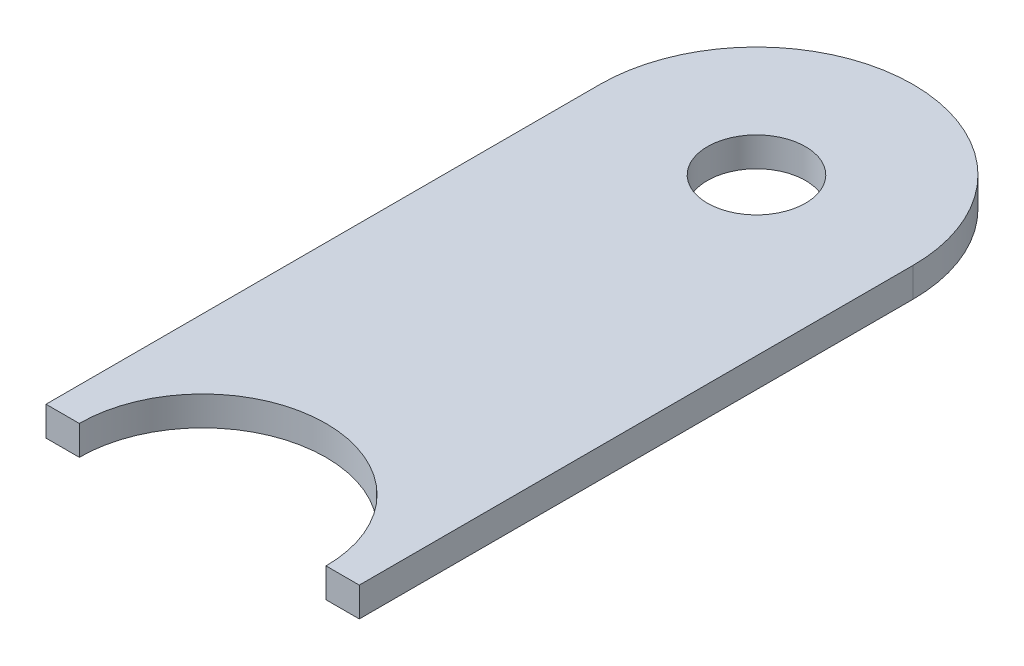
from build123d import *

# Parameters (mm, degrees)
SKETCH2_R           = 5.008424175
BOSS_EXTRUDE1_DEPTH = 3


with BuildPart() as part:
    # Sketch2 → Boss-Extrude1 (new body)
    with BuildSketch(Plane(origin=(0, 0, 0), x_dir=(1, 0, 0), z_dir=(0, 1, 0))):
        with BuildLine():
            Line((0, 0), (0, 56.57))
            ThreePointArc((0, 56.57), (16, 72.57), (32, 56.57))
            Line((32, 56.57), (32, 0))
            Line((32, 0), (28.6, 0))
            ThreePointArc((28.6, 0), (16, 12.6), (3.4, 0))
            Line((3.4, 0), (0, 0))
        make_face()
        with Locations(Location((16, 56.57, 0), (0, 0, 270))):
            Circle(SKETCH2_R, mode=Mode.SUBTRACT)
    extrude(amount=BOSS_EXTRUDE1_DEPTH)


solid = part.part
